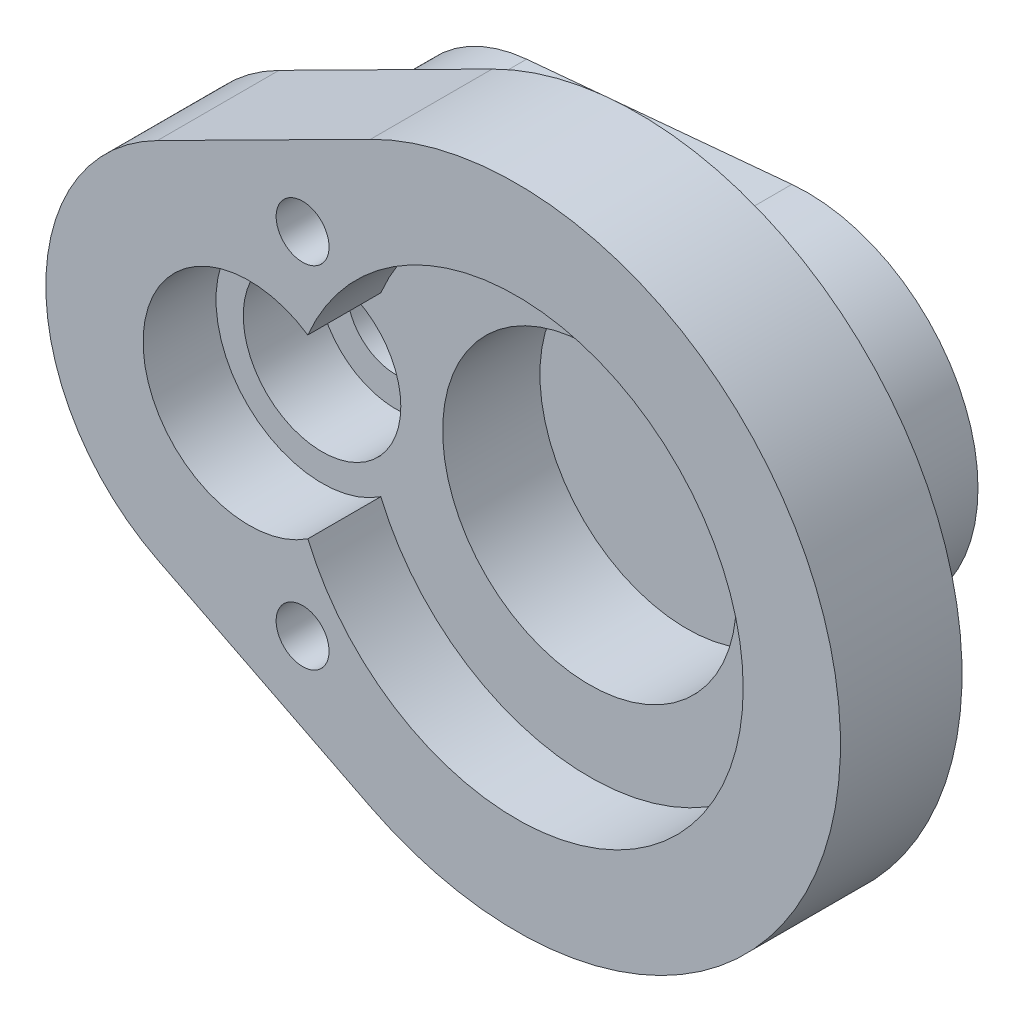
from build123d import *

# Parameters (mm, degrees)
BOSS_EXTRUDE2_DEPTH       = 6.35
BOSS_EXTRUDE3_DEPTH       = 4.699
BOSS_EXTRUDE4_DEPTH       = 7.9375
SKETCH8_R                 = 3.2004
CUT_EXTRUDE1_DEPTH        = 42.859265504
CUT_EXTRUDE2_DEPTH        = 4.7625
SKETCH10_R                = 9.5885
CUT_EXTRUDE3_DEPTH        = 6.35
SKETCH11_R                = 5.1435
CUT_EXTRUDE4_DEPTH        = 4.826
F_8_32_TAPPED_HOLE2_D     = 3.4544
F_8_32_TAPPED_HOLE2_DEPTH = 6.35
F_8_32_TAPPED_HOLE2_TIP   = 1.037806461


with BuildPart() as part:
    # Sketch3 → Boss-Extrude2 (new body)
    with BuildSketch(Plane.XY):
        with BuildLine():
            Line((-18.330718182, 9.51085366), (-1.012536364, 11.091780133))
            ThreePointArc((-1.012536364, 11.091780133), (11.1379, 0), (-1.012536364, -11.091780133))
            Line((-1.012536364, -11.091780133), (-18.330718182, -9.51085366))
            ThreePointArc((-18.330718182, -9.51085366), (-27.0129, 0), (-18.330718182, 9.51085366))
        make_face()
    extrude(amount=BOSS_EXTRUDE2_DEPTH)

    # Sketch5 → Boss-Extrude3 (add)
    with BuildSketch(Plane.XY.offset(6.35)):
        with BuildLine():
            Line((-19.984027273, 9.579704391), (-3.652981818, 13.878289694))
            ThreePointArc((-3.652981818, 13.878289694), (14.351, 0), (-3.652981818, -13.878289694))
            Line((-3.652981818, -13.878289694), (-19.984027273, -9.579704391))
            ThreePointArc((-19.984027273, -9.579704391), (-27.3685, 0), (-19.984027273, 9.579704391))
        make_face()
    extrude(amount=BOSS_EXTRUDE3_DEPTH)

    # Sketch7 → Boss-Extrude4 (add)
    with BuildSketch(Plane.XY.offset(11.049)):
        with BuildLine():
            Line((-23.44674, -11.84574117), (-9.534698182, -18.87383641))
            ThreePointArc((-9.534698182, -18.87383641), (21.1455, 0), (-9.534698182, 18.87383641))
            Line((-9.534698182, 18.87383641), (-23.44674, 11.84574117))
            ThreePointArc((-23.44674, 11.84574117), (-30.734, 0), (-23.44674, -11.84574117))
        make_face()
    extrude(amount=BOSS_EXTRUDE4_DEPTH)

    # Sketch8 → Cut-Extrude1 (cut, through all)
    with BuildSketch(Plane.XY.offset(18.9865)):
        with Locations((-17.4625, 0)):
            Circle(SKETCH8_R)
    extrude(amount=-CUT_EXTRUDE1_DEPTH, mode=Mode.SUBTRACT)

    # Sketch9 → Cut-Extrude2 (cut)
    with BuildSketch(Plane.XY.offset(18.9865)):
        with BuildLine():
            ThreePointArc((-13.627446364, -5.761902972), (14.7955, 0), (-13.627446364, 5.761902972))
            ThreePointArc((-13.627446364, 5.761902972), (-24.384, 0), (-13.627446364, -5.761902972))
        make_face()
    extrude(amount=-CUT_EXTRUDE2_DEPTH, mode=Mode.SUBTRACT)

    # Sketch10 → Cut-Extrude3 (cut)
    with BuildSketch(Plane.XY.offset(14.224)):
        Circle(SKETCH10_R)
    extrude(amount=-CUT_EXTRUDE3_DEPTH, mode=Mode.SUBTRACT)

    # Sketch11 → Cut-Extrude4 (cut)
    with BuildSketch(Plane.XY.offset(14.224)):
        with Locations((-17.4625, 0)):
            Circle(SKETCH11_R)
    extrude(amount=-CUT_EXTRUDE4_DEPTH, mode=Mode.SUBTRACT)

    # 8-32 Tapped Hole2
    with Locations(Plane.XY.offset(18.9865)):
        with Locations((-13.97, 11.43), (-13.97, -11.43)):
            Hole(F_8_32_TAPPED_HOLE2_D / 2, depth=F_8_32_TAPPED_HOLE2_DEPTH)
            with Locations((0, 0, -(F_8_32_TAPPED_HOLE2_DEPTH + F_8_32_TAPPED_HOLE2_TIP / 2))):  # 118° drill point
                Cone(0, F_8_32_TAPPED_HOLE2_D / 2, F_8_32_TAPPED_HOLE2_TIP, mode=Mode.SUBTRACT)


solid = part.part
